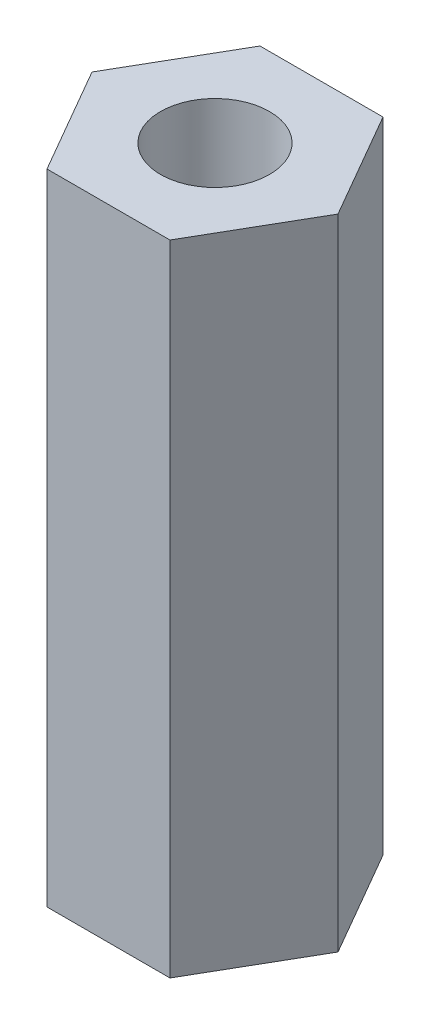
from build123d import *

# Parameters (mm, degrees)
SKETCH1_R           = 1.6256
BOSS_EXTRUDE1_DEPTH = 19.05


with BuildPart() as part:
    # Sketch1 → Boss-Extrude1 (new body)
    with BuildSketch(Plane(origin=(0, 0, 0), x_dir=(1, 0, 0), z_dir=(0, 1, 0))):
        Polygon((1.833087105, 3.175), (-1.833087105, 3.175), (-3.666174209, 0), (-1.833087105, -3.175), (1.833087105, -3.175), (3.666174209, 0), align=None)
        with Locations(Location((0, 0, 0), (0, 0, 90))):
            Circle(SKETCH1_R, mode=Mode.SUBTRACT)
    extrude(amount=BOSS_EXTRUDE1_DEPTH)


solid = part.part
